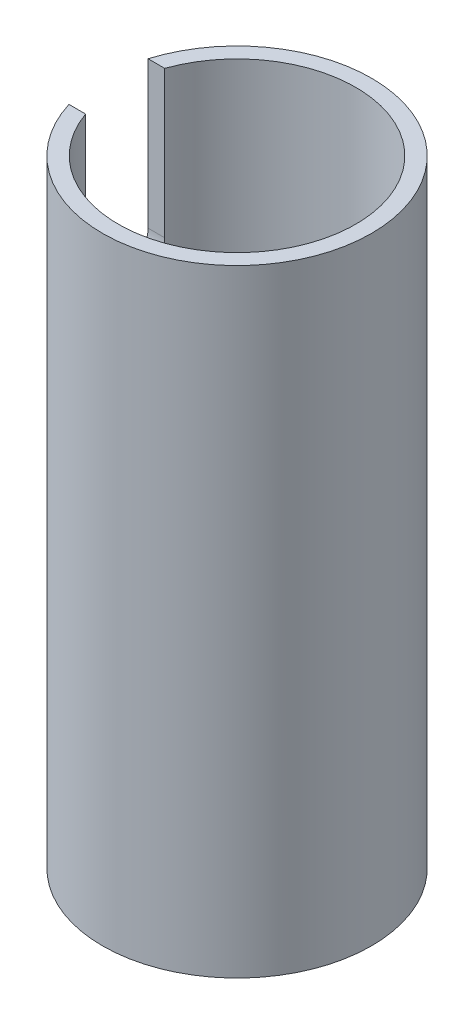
from build123d import *

# Parameters (mm, degrees)
ESQUISSE1_R             = 8.5
ESQUISSE1_R_2           = 7.5
BOSS_EXTRU_1_DEPTH      = 39
ENL_V_MAT_EXTRU_1_DEPTH = 10


with BuildPart() as part:
    # Esquisse1 → Boss.-Extru.1 (new body)
    with BuildSketch(Plane(origin=(0, 0, 0), x_dir=(1, 0, 0), z_dir=(0, 1, 0))):
        with Locations(Location((0, 0, 0), (0, 0, 270))):
            Circle(ESQUISSE1_R)
        with Locations(Location((0, 0, 0), (0, 0, 270))):
            Circle(ESQUISSE1_R_2, mode=Mode.SUBTRACT)
    extrude(amount=BOSS_EXTRU_1_DEPTH)

    # Esquisse2 → Enl_v. mat.-Extru.1 (cut)
    with BuildSketch(Plane(origin=(0, 0, 0), x_dir=(0, 0, -1), z_dir=(1, 0, 0))):
        with BuildLine():
            Line((2.5, 42.948211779), (2.5, 29.724850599))
            ThreePointArc((2.5, 29.724850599), (0, 27.224850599), (-2.5, 29.724850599))
            Line((-2.5, 29.724850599), (-2.5, 42.948211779))
            ThreePointArc((-2.5, 42.948211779), (0, 45.448211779), (2.5, 42.948211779))
        make_face()
    extrude(amount=-ENL_V_MAT_EXTRU_1_DEPTH, mode=Mode.SUBTRACT)


solid = part.part
